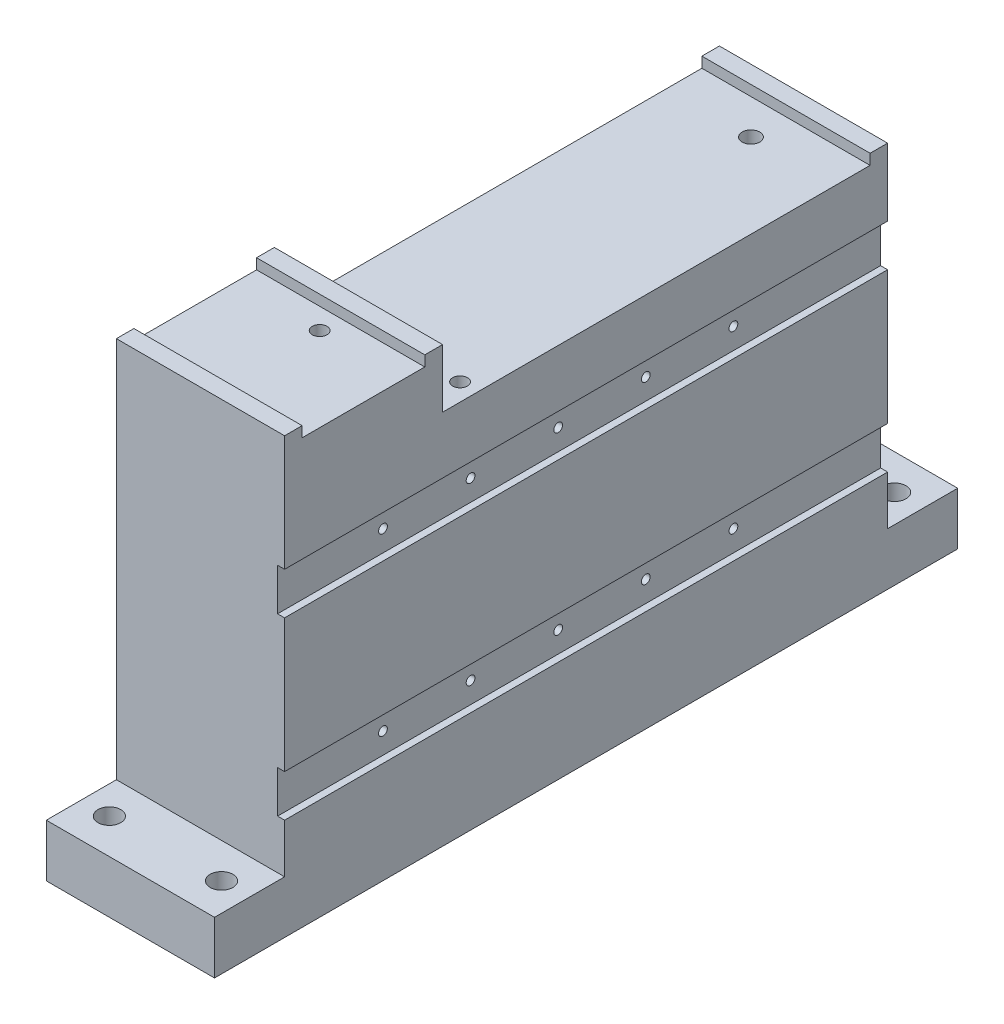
ISO-10303-21;
HEADER;
FILE_DESCRIPTION(('STEP AP214'),'2;1');
FILE_NAME('part.step','',(''),(''),'','','');
FILE_SCHEMA(('AUTOMOTIVE_DESIGN { 1 0 10303 214 1 1 1 1 }'));
ENDSEC;
DATA;
#1=APPLICATION_CONTEXT('core data for automotive mechanical design processes');
#2=APPLICATION_PROTOCOL_DEFINITION('international standard','automotive_design',2000,#1);
#3=PRODUCT_CONTEXT('',#1,'mechanical');
#4=PRODUCT('Part','Part','',(#3));
#5=PRODUCT_RELATED_PRODUCT_CATEGORY('part','',(#4));
#6=PRODUCT_DEFINITION_FORMATION('','',#4);
#7=PRODUCT_DEFINITION_CONTEXT('part definition',#1,'design');
#8=PRODUCT_DEFINITION('design','',#6,#7);
#9=PRODUCT_DEFINITION_SHAPE('','',#8);
#10=(LENGTH_UNIT() NAMED_UNIT(*) SI_UNIT(.MILLI.,.METRE.));
#11=(NAMED_UNIT(*) PLANE_ANGLE_UNIT() SI_UNIT($,.RADIAN.));
#12=(NAMED_UNIT(*) SI_UNIT($,.STERADIAN.) SOLID_ANGLE_UNIT());
#13=UNCERTAINTY_MEASURE_WITH_UNIT(LENGTH_MEASURE(1.E-05),#10,'distance_accuracy_value','');
#14=(GEOMETRIC_REPRESENTATION_CONTEXT(3) GLOBAL_UNCERTAINTY_ASSIGNED_CONTEXT((#13)) GLOBAL_UNIT_ASSIGNED_CONTEXT((#10,
#11,#12)) REPRESENTATION_CONTEXT('',''));
#15=CARTESIAN_POINT('',(0.,0.,0.));
#16=DIRECTION('',(0.,0.,1.));
#17=DIRECTION('',(1.,0.,0.));
#18=AXIS2_PLACEMENT_3D('',#15,#16,#17);
#19=CARTESIAN_POINT('',(48.,0.,212.0716));
#20=DIRECTION('',(-1.,0.,0.));
#21=DIRECTION('',(0.,0.,1.));
#22=AXIS2_PLACEMENT_3D('',#19,#20,#21);
#23=PLANE('',#22);
#24=DIRECTION('',(0.,1.,0.));
#25=VECTOR('',#24,1.);
#26=CARTESIAN_POINT('',(48.,15.,20.));
#27=LINE('',#26,#25);
#28=CARTESIAN_POINT('',(48.,15.,20.));
#29=VERTEX_POINT('',#28);
#30=CARTESIAN_POINT('',(48.,29.,20.));
#31=VERTEX_POINT('',#30);
#32=EDGE_CURVE('E446',#29,#31,#27,.T.);
#33=ORIENTED_EDGE('',*,*,#32,.T.);
#34=DIRECTION('',(0.,0.,-1.));
#35=VECTOR('',#34,1.);
#36=CARTESIAN_POINT('',(48.,29.,212.0716));
#37=LINE('',#36,#35);
#38=CARTESIAN_POINT('',(48.,29.,192.071629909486));
#39=VERTEX_POINT('',#38);
#40=EDGE_CURVE('E246',#39,#31,#37,.T.);
#41=ORIENTED_EDGE('',*,*,#40,.F.);
#42=DIRECTION('',(0.,-1.,0.));
#43=VECTOR('',#42,1.);
#44=CARTESIAN_POINT('',(48.,15.,192.071629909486));
#45=LINE('',#44,#43);
#46=CARTESIAN_POINT('',(48.,15.,192.071629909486));
#47=VERTEX_POINT('',#46);
#48=EDGE_CURVE('E461',#39,#47,#45,.T.);
#49=ORIENTED_EDGE('',*,*,#48,.T.);
#50=DIRECTION('',(0.,0.,1.));
#51=VECTOR('',#50,1.);
#52=CARTESIAN_POINT('',(48.,15.,212.071629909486));
#53=LINE('',#52,#51);
#54=CARTESIAN_POINT('',(48.,15.,212.0716));
#55=VERTEX_POINT('',#54);
#56=EDGE_CURVE('E454',#47,#55,#53,.T.);
#57=ORIENTED_EDGE('',*,*,#56,.T.);
#58=DIRECTION('',(0.,1.,0.));
#59=VECTOR('',#58,1.);
#60=CARTESIAN_POINT('',(48.,0.,212.0716));
#61=LINE('',#60,#59);
#62=CARTESIAN_POINT('',(48.,0.,212.0716));
#63=VERTEX_POINT('',#62);
#64=EDGE_CURVE('E339',#63,#55,#61,.T.);
#65=ORIENTED_EDGE('',*,*,#64,.F.);
#66=DIRECTION('',(0.,0.,-1.));
#67=VECTOR('',#66,1.);
#68=CARTESIAN_POINT('',(48.,0.,212.0716));
#69=LINE('',#68,#67);
#70=CARTESIAN_POINT('',(48.,0.,0.));
#71=VERTEX_POINT('',#70);
#72=EDGE_CURVE('E249',#63,#71,#69,.T.);
#73=ORIENTED_EDGE('',*,*,#72,.T.);
#74=DIRECTION('',(0.,1.,0.));
#75=VECTOR('',#74,1.);
#76=CARTESIAN_POINT('',(48.,0.,0.));
#77=LINE('',#76,#75);
#78=CARTESIAN_POINT('',(48.,15.,0.));
#79=VERTEX_POINT('',#78);
#80=EDGE_CURVE('E345',#71,#79,#77,.T.);
#81=ORIENTED_EDGE('',*,*,#80,.T.);
#82=DIRECTION('',(0.,0.,1.));
#83=VECTOR('',#82,1.);
#84=CARTESIAN_POINT('',(48.,15.,20.));
#85=LINE('',#84,#83);
#86=EDGE_CURVE('E451',#79,#29,#85,.T.);
#87=ORIENTED_EDGE('',*,*,#86,.T.);
#88=EDGE_LOOP('',(#33,#41,#49,#57,#65,#73,#81,#87));
#89=FACE_BOUND('',#88,.T.);
#90=ADVANCED_FACE('F33',(#89),#23,.F.);
#91=CARTESIAN_POINT('',(46.,29.,212.0716));
#92=DIRECTION('',(0.,-1.,0.));
#93=DIRECTION('',(0.,0.,-1.));
#94=AXIS2_PLACEMENT_3D('',#91,#92,#93);
#95=PLANE('',#94);
#96=DIRECTION('',(1.,0.,0.));
#97=VECTOR('',#96,1.);
#98=CARTESIAN_POINT('',(46.,29.,20.));
#99=LINE('',#98,#97);
#100=CARTESIAN_POINT('',(46.,29.,20.));
#101=VERTEX_POINT('',#100);
#102=EDGE_CURVE('E293',#101,#31,#99,.T.);
#103=ORIENTED_EDGE('',*,*,#102,.F.);
#104=DIRECTION('',(0.,0.,-1.));
#105=VECTOR('',#104,1.);
#106=CARTESIAN_POINT('',(46.,29.,212.0716));
#107=LINE('',#106,#105);
#108=CARTESIAN_POINT('',(46.,29.,192.071629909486));
#109=VERTEX_POINT('',#108);
#110=EDGE_CURVE('E243',#109,#101,#107,.T.);
#111=ORIENTED_EDGE('',*,*,#110,.F.);
#112=DIRECTION('',(-1.,0.,0.));
#113=VECTOR('',#112,1.);
#114=CARTESIAN_POINT('',(46.,29.,192.071629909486));
#115=LINE('',#114,#113);
#116=EDGE_CURVE('E397',#39,#109,#115,.T.);
#117=ORIENTED_EDGE('',*,*,#116,.F.);
#118=ORIENTED_EDGE('',*,*,#40,.T.);
#119=EDGE_LOOP('',(#103,#111,#117,#118));
#120=FACE_BOUND('',#119,.T.);
#121=ADVANCED_FACE('F578',(#120),#95,.F.);
#122=CARTESIAN_POINT('',(46.,29.,212.0716));
#123=DIRECTION('',(-1.,0.,0.));
#124=DIRECTION('',(0.,0.,1.));
#125=AXIS2_PLACEMENT_3D('',#122,#123,#124);
#126=PLANE('',#125);
#127=CARTESIAN_POINT('',(46.,34.9999999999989,162.));
#128=DIRECTION('',(-1.,0.,0.));
#129=DIRECTION('',(0.,0.,1.));
#130=AXIS2_PLACEMENT_3D('',#127,#128,#129);
#131=CIRCLE('',#130,1.25);
#132=CARTESIAN_POINT('',(46.,34.9999999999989,163.25));
#133=VERTEX_POINT('',#132);
#134=EDGE_CURVE('E269',#133,#133,#131,.T.);
#135=ORIENTED_EDGE('',*,*,#134,.T.);
#136=EDGE_LOOP('',(#135));
#137=FACE_BOUND('',#136,.T.);
#138=CARTESIAN_POINT('',(46.,34.9999999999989,137.));
#139=DIRECTION('',(-1.,0.,0.));
#140=DIRECTION('',(0.,0.,1.));
#141=AXIS2_PLACEMENT_3D('',#138,#139,#140);
#142=CIRCLE('',#141,1.25);
#143=CARTESIAN_POINT('',(46.,34.9999999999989,138.25));
#144=VERTEX_POINT('',#143);
#145=EDGE_CURVE('E265',#144,#144,#142,.T.);
#146=ORIENTED_EDGE('',*,*,#145,.T.);
#147=EDGE_LOOP('',(#146));
#148=FACE_BOUND('',#147,.T.);
#149=CARTESIAN_POINT('',(46.,34.9999999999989,112.));
#150=DIRECTION('',(-1.,0.,0.));
#151=DIRECTION('',(0.,0.,1.));
#152=AXIS2_PLACEMENT_3D('',#149,#150,#151);
#153=CIRCLE('',#152,1.25);
#154=CARTESIAN_POINT('',(46.,34.9999999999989,113.25));
#155=VERTEX_POINT('',#154);
#156=EDGE_CURVE('E261',#155,#155,#153,.T.);
#157=ORIENTED_EDGE('',*,*,#156,.T.);
#158=EDGE_LOOP('',(#157));
#159=FACE_BOUND('',#158,.T.);
#160=CARTESIAN_POINT('',(46.,34.9999999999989,87.));
#161=DIRECTION('',(-1.,0.,0.));
#162=DIRECTION('',(0.,0.,1.));
#163=AXIS2_PLACEMENT_3D('',#160,#161,#162);
#164=CIRCLE('',#163,1.25);
#165=CARTESIAN_POINT('',(46.,34.9999999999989,88.25));
#166=VERTEX_POINT('',#165);
#167=EDGE_CURVE('E257',#166,#166,#164,.T.);
#168=ORIENTED_EDGE('',*,*,#167,.T.);
#169=EDGE_LOOP('',(#168));
#170=FACE_BOUND('',#169,.T.);
#171=CARTESIAN_POINT('',(46.,34.9999999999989,62.));
#172=DIRECTION('',(-1.,0.,0.));
#173=DIRECTION('',(0.,0.,1.));
#174=AXIS2_PLACEMENT_3D('',#171,#172,#173);
#175=CIRCLE('',#174,1.25);
#176=CARTESIAN_POINT('',(46.,34.9999999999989,63.25));
#177=VERTEX_POINT('',#176);
#178=EDGE_CURVE('E256',#177,#177,#175,.T.);
#179=ORIENTED_EDGE('',*,*,#178,.T.);
#180=EDGE_LOOP('',(#179));
#181=FACE_BOUND('',#180,.T.);
#182=DIRECTION('',(0.,-1.,0.));
#183=VECTOR('',#182,1.);
#184=CARTESIAN_POINT('',(46.,29.,20.));
#185=LINE('',#184,#183);
#186=CARTESIAN_POINT('',(46.,41.,20.));
#187=VERTEX_POINT('',#186);
#188=EDGE_CURVE('E387',#187,#101,#185,.T.);
#189=ORIENTED_EDGE('',*,*,#188,.F.);
#190=DIRECTION('',(0.,0.,-1.));
#191=VECTOR('',#190,1.);
#192=CARTESIAN_POINT('',(46.,41.,212.0716));
#193=LINE('',#192,#191);
#194=CARTESIAN_POINT('',(46.,41.,192.071629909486));
#195=VERTEX_POINT('',#194);
#196=EDGE_CURVE('E240',#195,#187,#193,.T.);
#197=ORIENTED_EDGE('',*,*,#196,.F.);
#198=DIRECTION('',(0.,1.,0.));
#199=VECTOR('',#198,1.);
#200=CARTESIAN_POINT('',(46.,29.,192.071629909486));
#201=LINE('',#200,#199);
#202=EDGE_CURVE('E399',#109,#195,#201,.T.);
#203=ORIENTED_EDGE('',*,*,#202,.F.);
#204=ORIENTED_EDGE('',*,*,#110,.T.);
#205=EDGE_LOOP('',(#189,#197,#203,#204));
#206=FACE_BOUND('',#205,.T.);
#207=ADVANCED_FACE('F582',(#137,#148,#159,#170,#181,#206),#126,.F.);
#208=CARTESIAN_POINT('',(46.,41.,212.0716));
#209=DIRECTION('',(0.,1.,0.));
#210=DIRECTION('',(-1.,0.,0.));
#211=AXIS2_PLACEMENT_3D('',#208,#209,#210);
#212=PLANE('',#211);
#213=DIRECTION('',(-1.,0.,0.));
#214=VECTOR('',#213,1.);
#215=CARTESIAN_POINT('',(46.,41.,20.));
#216=LINE('',#215,#214);
#217=CARTESIAN_POINT('',(48.,40.9999999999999,20.));
#218=VERTEX_POINT('',#217);
#219=EDGE_CURVE('E389',#218,#187,#216,.T.);
#220=ORIENTED_EDGE('',*,*,#219,.F.);
#221=DIRECTION('',(0.,0.,-1.));
#222=VECTOR('',#221,1.);
#223=CARTESIAN_POINT('',(48.,40.9999999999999,212.0716));
#224=LINE('',#223,#222);
#225=CARTESIAN_POINT('',(48.,40.9999999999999,192.071629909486));
#226=VERTEX_POINT('',#225);
#227=EDGE_CURVE('E237',#226,#218,#224,.T.);
#228=ORIENTED_EDGE('',*,*,#227,.F.);
#229=DIRECTION('',(1.,0.,0.));
#230=VECTOR('',#229,1.);
#231=CARTESIAN_POINT('',(46.,41.,192.071629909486));
#232=LINE('',#231,#230);
#233=EDGE_CURVE('E401',#195,#226,#232,.T.);
#234=ORIENTED_EDGE('',*,*,#233,.F.);
#235=ORIENTED_EDGE('',*,*,#196,.T.);
#236=EDGE_LOOP('',(#220,#228,#234,#235));
#237=FACE_BOUND('',#236,.T.);
#238=ADVANCED_FACE('F588',(#237),#212,.F.);
#239=CARTESIAN_POINT('',(48.,40.9999999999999,212.0716));
#240=DIRECTION('',(-1.,0.,0.));
#241=DIRECTION('',(0.,0.,1.));
#242=AXIS2_PLACEMENT_3D('',#239,#240,#241);
#243=PLANE('',#242);
#244=CARTESIAN_POINT('',(48.,78.9999999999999,20.));
#245=VERTEX_POINT('',#244);
#246=EDGE_CURVE('E449',#218,#245,#27,.T.);
#247=ORIENTED_EDGE('',*,*,#246,.T.);
#248=DIRECTION('',(0.,0.,-1.));
#249=VECTOR('',#248,1.);
#250=CARTESIAN_POINT('',(48.,78.9999999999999,212.0716));
#251=LINE('',#250,#249);
#252=CARTESIAN_POINT('',(48.,78.9999999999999,192.071629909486));
#253=VERTEX_POINT('',#252);
#254=EDGE_CURVE('E234',#253,#245,#251,.T.);
#255=ORIENTED_EDGE('',*,*,#254,.F.);
#256=EDGE_CURVE('E460',#253,#226,#45,.T.);
#257=ORIENTED_EDGE('',*,*,#256,.T.);
#258=ORIENTED_EDGE('',*,*,#227,.T.);
#259=EDGE_LOOP('',(#247,#255,#257,#258));
#260=FACE_BOUND('',#259,.T.);
#261=ADVANCED_FACE('F539',(#260),#243,.F.);
#262=CARTESIAN_POINT('',(46.,78.9999999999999,212.0716));
#263=DIRECTION('',(0.,-1.,0.));
#264=DIRECTION('',(0.,0.,-1.));
#265=AXIS2_PLACEMENT_3D('',#262,#263,#264);
#266=PLANE('',#265);
#267=DIRECTION('',(1.,0.,0.));
#268=VECTOR('',#267,1.);
#269=CARTESIAN_POINT('',(46.,78.9999999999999,20.));
#270=LINE('',#269,#268);
#271=CARTESIAN_POINT('',(46.,78.9999999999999,20.));
#272=VERTEX_POINT('',#271);
#273=EDGE_CURVE('E391',#272,#245,#270,.T.);
#274=ORIENTED_EDGE('',*,*,#273,.F.);
#275=DIRECTION('',(0.,0.,-1.));
#276=VECTOR('',#275,1.);
#277=CARTESIAN_POINT('',(46.,78.9999999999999,212.0716));
#278=LINE('',#277,#276);
#279=CARTESIAN_POINT('',(46.,78.9999999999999,192.071629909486));
#280=VERTEX_POINT('',#279);
#281=EDGE_CURVE('E231',#280,#272,#278,.T.);
#282=ORIENTED_EDGE('',*,*,#281,.F.);
#283=DIRECTION('',(-1.,0.,0.));
#284=VECTOR('',#283,1.);
#285=CARTESIAN_POINT('',(46.,78.9999999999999,192.071629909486));
#286=LINE('',#285,#284);
#287=EDGE_CURVE('E403',#253,#280,#286,.T.);
#288=ORIENTED_EDGE('',*,*,#287,.F.);
#289=ORIENTED_EDGE('',*,*,#254,.T.);
#290=EDGE_LOOP('',(#274,#282,#288,#289));
#291=FACE_BOUND('',#290,.T.);
#292=ADVANCED_FACE('F534',(#291),#266,.F.);
#293=CARTESIAN_POINT('',(46.,78.9999999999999,212.0716));
#294=DIRECTION('',(-1.,0.,0.));
#295=DIRECTION('',(0.,0.,1.));
#296=AXIS2_PLACEMENT_3D('',#293,#294,#295);
#297=PLANE('',#296);
#298=CARTESIAN_POINT('',(46.,84.9999999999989,62.));
#299=DIRECTION('',(-1.,0.,0.));
#300=DIRECTION('',(0.,0.,1.));
#301=AXIS2_PLACEMENT_3D('',#298,#299,#300);
#302=CIRCLE('',#301,1.25);
#303=CARTESIAN_POINT('',(46.,84.9999999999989,63.25));
#304=VERTEX_POINT('',#303);
#305=EDGE_CURVE('E289',#304,#304,#302,.T.);
#306=ORIENTED_EDGE('',*,*,#305,.T.);
#307=EDGE_LOOP('',(#306));
#308=FACE_BOUND('',#307,.T.);
#309=CARTESIAN_POINT('',(46.,84.9999999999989,87.));
#310=DIRECTION('',(-1.,0.,0.));
#311=DIRECTION('',(0.,0.,1.));
#312=AXIS2_PLACEMENT_3D('',#309,#310,#311);
#313=CIRCLE('',#312,1.25);
#314=CARTESIAN_POINT('',(46.,84.9999999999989,88.25));
#315=VERTEX_POINT('',#314);
#316=EDGE_CURVE('E285',#315,#315,#313,.T.);
#317=ORIENTED_EDGE('',*,*,#316,.T.);
#318=EDGE_LOOP('',(#317));
#319=FACE_BOUND('',#318,.T.);
#320=CARTESIAN_POINT('',(46.,84.9999999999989,112.));
#321=DIRECTION('',(-1.,0.,0.));
#322=DIRECTION('',(0.,0.,1.));
#323=AXIS2_PLACEMENT_3D('',#320,#321,#322);
#324=CIRCLE('',#323,1.25);
#325=CARTESIAN_POINT('',(46.,84.9999999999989,113.25));
#326=VERTEX_POINT('',#325);
#327=EDGE_CURVE('E281',#326,#326,#324,.T.);
#328=ORIENTED_EDGE('',*,*,#327,.T.);
#329=EDGE_LOOP('',(#328));
#330=FACE_BOUND('',#329,.T.);
#331=CARTESIAN_POINT('',(46.,84.9999999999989,137.));
#332=DIRECTION('',(-1.,0.,0.));
#333=DIRECTION('',(0.,0.,1.));
#334=AXIS2_PLACEMENT_3D('',#331,#332,#333);
#335=CIRCLE('',#334,1.25);
#336=CARTESIAN_POINT('',(46.,84.9999999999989,138.25));
#337=VERTEX_POINT('',#336);
#338=EDGE_CURVE('E277',#337,#337,#335,.T.);
#339=ORIENTED_EDGE('',*,*,#338,.T.);
#340=EDGE_LOOP('',(#339));
#341=FACE_BOUND('',#340,.T.);
#342=CARTESIAN_POINT('',(46.,85.,162.));
#343=DIRECTION('',(-1.,0.,0.));
#344=DIRECTION('',(0.,0.,1.));
#345=AXIS2_PLACEMENT_3D('',#342,#343,#344);
#346=CIRCLE('',#345,1.25);
#347=CARTESIAN_POINT('',(46.,85.,163.25));
#348=VERTEX_POINT('',#347);
#349=EDGE_CURVE('E273',#348,#348,#346,.T.);
#350=ORIENTED_EDGE('',*,*,#349,.T.);
#351=EDGE_LOOP('',(#350));
#352=FACE_BOUND('',#351,.T.);
#353=DIRECTION('',(0.,-1.,0.));
#354=VECTOR('',#353,1.);
#355=CARTESIAN_POINT('',(46.,78.9999999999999,20.));
#356=LINE('',#355,#354);
#357=CARTESIAN_POINT('',(46.,90.9999999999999,20.));
#358=VERTEX_POINT('',#357);
#359=EDGE_CURVE('E393',#358,#272,#356,.T.);
#360=ORIENTED_EDGE('',*,*,#359,.F.);
#361=DIRECTION('',(0.,0.,-1.));
#362=VECTOR('',#361,1.);
#363=CARTESIAN_POINT('',(46.,90.9999999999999,212.0716));
#364=LINE('',#363,#362);
#365=CARTESIAN_POINT('',(46.,90.9999999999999,192.071629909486));
#366=VERTEX_POINT('',#365);
#367=EDGE_CURVE('E228',#366,#358,#364,.T.);
#368=ORIENTED_EDGE('',*,*,#367,.F.);
#369=DIRECTION('',(0.,1.,0.));
#370=VECTOR('',#369,1.);
#371=CARTESIAN_POINT('',(46.,78.9999999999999,192.071629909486));
#372=LINE('',#371,#370);
#373=EDGE_CURVE('E405',#280,#366,#372,.T.);
#374=ORIENTED_EDGE('',*,*,#373,.F.);
#375=ORIENTED_EDGE('',*,*,#281,.T.);
#376=EDGE_LOOP('',(#360,#368,#374,#375));
#377=FACE_BOUND('',#376,.T.);
#378=ADVANCED_FACE('F529',(#308,#319,#330,#341,#352,#377),#297,.F.);
#379=CARTESIAN_POINT('',(46.,90.9999999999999,212.0716));
#380=DIRECTION('',(0.,1.,0.));
#381=DIRECTION('',(0.,0.,1.));
#382=AXIS2_PLACEMENT_3D('',#379,#380,#381);
#383=PLANE('',#382);
#384=DIRECTION('',(-1.,0.,0.));
#385=VECTOR('',#384,1.);
#386=CARTESIAN_POINT('',(46.,90.9999999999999,20.));
#387=LINE('',#386,#385);
#388=CARTESIAN_POINT('',(48.,90.9999999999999,20.));
#389=VERTEX_POINT('',#388);
#390=EDGE_CURVE('E395',#389,#358,#387,.T.);
#391=ORIENTED_EDGE('',*,*,#390,.F.);
#392=DIRECTION('',(0.,0.,-1.));
#393=VECTOR('',#392,1.);
#394=CARTESIAN_POINT('',(48.,90.9999999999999,212.0716));
#395=LINE('',#394,#393);
#396=CARTESIAN_POINT('',(48.,90.9999999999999,192.071629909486));
#397=VERTEX_POINT('',#396);
#398=EDGE_CURVE('E221',#397,#389,#395,.T.);
#399=ORIENTED_EDGE('',*,*,#398,.F.);
#400=DIRECTION('',(1.,0.,0.));
#401=VECTOR('',#400,1.);
#402=CARTESIAN_POINT('',(46.,90.9999999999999,192.071629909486));
#403=LINE('',#402,#401);
#404=EDGE_CURVE('E407',#366,#397,#403,.T.);
#405=ORIENTED_EDGE('',*,*,#404,.F.);
#406=ORIENTED_EDGE('',*,*,#367,.T.);
#407=EDGE_LOOP('',(#391,#399,#405,#406));
#408=FACE_BOUND('',#407,.T.);
#409=ADVANCED_FACE('F522',(#408),#383,.F.);
#410=CARTESIAN_POINT('',(48.,90.9999999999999,212.0716));
#411=DIRECTION('',(-1.,0.,0.));
#412=DIRECTION('',(0.,0.,1.));
#413=AXIS2_PLACEMENT_3D('',#410,#411,#412);
#414=PLANE('',#413);
#415=DIRECTION('',(0.,1.,0.));
#416=VECTOR('',#415,1.);
#417=CARTESIAN_POINT('',(48.,107.280000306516,147.));
#418=LINE('',#417,#416);
#419=CARTESIAN_POINT('',(48.,107.280000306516,147.));
#420=VERTEX_POINT('',#419);
#421=CARTESIAN_POINT('',(48.,124.,147.));
#422=VERTEX_POINT('',#421);
#423=EDGE_CURVE('E201',#420,#422,#418,.T.);
#424=ORIENTED_EDGE('',*,*,#423,.T.);
#425=DIRECTION('',(0.,0.,-1.));
#426=VECTOR('',#425,1.);
#427=CARTESIAN_POINT('',(48.,124.,212.0716));
#428=LINE('',#427,#426);
#429=CARTESIAN_POINT('',(48.,124.,152.071629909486));
#430=VERTEX_POINT('',#429);
#431=EDGE_CURVE('E208',#430,#422,#428,.T.);
#432=ORIENTED_EDGE('',*,*,#431,.F.);
#433=DIRECTION('',(0.,-1.,0.));
#434=VECTOR('',#433,1.);
#435=CARTESIAN_POINT('',(48.,121.,152.071629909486));
#436=LINE('',#435,#434);
#437=CARTESIAN_POINT('',(48.,121.,152.071629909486));
#438=VERTEX_POINT('',#437);
#439=EDGE_CURVE('E192',#430,#438,#436,.T.);
#440=ORIENTED_EDGE('',*,*,#439,.T.);
#441=DIRECTION('',(0.,0.,1.));
#442=VECTOR('',#441,1.);
#443=CARTESIAN_POINT('',(48.,121.,187.071629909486));
#444=LINE('',#443,#442);
#445=CARTESIAN_POINT('',(48.,121.,187.071629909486));
#446=VERTEX_POINT('',#445);
#447=EDGE_CURVE('E200',#438,#446,#444,.T.);
#448=ORIENTED_EDGE('',*,*,#447,.T.);
#449=DIRECTION('',(0.,1.,0.));
#450=VECTOR('',#449,1.);
#451=CARTESIAN_POINT('',(48.,121.,187.071629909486));
#452=LINE('',#451,#450);
#453=CARTESIAN_POINT('',(48.,124.,187.071629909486));
#454=VERTEX_POINT('',#453);
#455=EDGE_CURVE('E462',#446,#454,#452,.T.);
#456=ORIENTED_EDGE('',*,*,#455,.T.);
#457=CARTESIAN_POINT('',(48.,124.,192.071629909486));
#458=VERTEX_POINT('',#457);
#459=EDGE_CURVE('E217',#458,#454,#428,.T.);
#460=ORIENTED_EDGE('',*,*,#459,.F.);
#461=EDGE_CURVE('E457',#458,#397,#45,.T.);
#462=ORIENTED_EDGE('',*,*,#461,.T.);
#463=ORIENTED_EDGE('',*,*,#398,.T.);
#464=CARTESIAN_POINT('',(48.,110.280000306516,20.));
#465=VERTEX_POINT('',#464);
#466=EDGE_CURVE('E450',#389,#465,#27,.T.);
#467=ORIENTED_EDGE('',*,*,#466,.T.);
#468=DIRECTION('',(0.,0.,1.));
#469=VECTOR('',#468,1.);
#470=CARTESIAN_POINT('',(48.,110.280000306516,25.));
#471=LINE('',#470,#469);
#472=CARTESIAN_POINT('',(48.,110.280000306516,25.));
#473=VERTEX_POINT('',#472);
#474=EDGE_CURVE('E443',#465,#473,#471,.T.);
#475=ORIENTED_EDGE('',*,*,#474,.T.);
#476=DIRECTION('',(0.,-1.,0.));
#477=VECTOR('',#476,1.);
#478=CARTESIAN_POINT('',(48.,107.280000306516,25.));
#479=LINE('',#478,#477);
#480=CARTESIAN_POINT('',(48.,107.280000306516,25.));
#481=VERTEX_POINT('',#480);
#482=EDGE_CURVE('E440',#473,#481,#479,.T.);
#483=ORIENTED_EDGE('',*,*,#482,.T.);
#484=DIRECTION('',(0.,0.,1.));
#485=VECTOR('',#484,1.);
#486=CARTESIAN_POINT('',(48.,107.280000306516,147.));
#487=LINE('',#486,#485);
#488=EDGE_CURVE('E417',#481,#420,#487,.T.);
#489=ORIENTED_EDGE('',*,*,#488,.T.);
#490=EDGE_LOOP('',(#424,#432,#440,#448,#456,#460,#462,#463,#467,#475,#483,#489));
#491=FACE_BOUND('',#490,.T.);
#492=ADVANCED_FACE('F214',(#491),#414,.F.);
#493=CARTESIAN_POINT('',(0.,124.,212.0716));
#494=DIRECTION('',(0.,-1.,0.));
#495=DIRECTION('',(0.,0.,-1.));
#496=AXIS2_PLACEMENT_3D('',#493,#494,#495);
#497=PLANE('',#496);
#498=DIRECTION('',(1.,0.,0.));
#499=VECTOR('',#498,1.);
#500=CARTESIAN_POINT('',(-164.0716,124.,147.));
#501=LINE('',#500,#499);
#502=CARTESIAN_POINT('',(0.,124.,147.));
#503=VERTEX_POINT('',#502);
#504=EDGE_CURVE('E211',#503,#422,#501,.T.);
#505=ORIENTED_EDGE('',*,*,#504,.F.);
#506=DIRECTION('',(0.,0.,-1.));
#507=VECTOR('',#506,1.);
#508=CARTESIAN_POINT('',(0.,124.,212.0716));
#509=LINE('',#508,#507);
#510=CARTESIAN_POINT('',(0.,124.,152.071629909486));
#511=VERTEX_POINT('',#510);
#512=EDGE_CURVE('E210',#511,#503,#509,.T.);
#513=ORIENTED_EDGE('',*,*,#512,.F.);
#514=DIRECTION('',(1.,0.,0.));
#515=VECTOR('',#514,1.);
#516=CARTESIAN_POINT('',(-164.0716,124.,152.071629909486));
#517=LINE('',#516,#515);
#518=EDGE_CURVE('E48',#511,#430,#517,.T.);
#519=ORIENTED_EDGE('',*,*,#518,.T.);
#520=ORIENTED_EDGE('',*,*,#431,.T.);
#521=EDGE_LOOP('',(#505,#513,#519,#520));
#522=FACE_BOUND('',#521,.T.);
#523=ADVANCED_FACE('F207',(#522),#497,.F.);
#524=DIRECTION('',(1.,0.,0.));
#525=VECTOR('',#524,1.);
#526=CARTESIAN_POINT('',(-164.0716,124.,192.071629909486));
#527=LINE('',#526,#525);
#528=CARTESIAN_POINT('',(0.,124.,192.071629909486));
#529=VERTEX_POINT('',#528);
#530=EDGE_CURVE('E424',#529,#458,#527,.T.);
#531=ORIENTED_EDGE('',*,*,#530,.T.);
#532=ORIENTED_EDGE('',*,*,#459,.T.);
#533=DIRECTION('',(1.,0.,0.));
#534=VECTOR('',#533,1.);
#535=CARTESIAN_POINT('',(-164.0716,124.,187.071629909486));
#536=LINE('',#535,#534);
#537=CARTESIAN_POINT('',(0.,124.,187.071629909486));
#538=VERTEX_POINT('',#537);
#539=EDGE_CURVE('E422',#538,#454,#536,.T.);
#540=ORIENTED_EDGE('',*,*,#539,.F.);
#541=EDGE_CURVE('E218',#529,#538,#509,.T.);
#542=ORIENTED_EDGE('',*,*,#541,.F.);
#543=EDGE_LOOP('',(#531,#532,#540,#542));
#544=FACE_BOUND('',#543,.T.);
#545=ADVANCED_FACE('F514',(#544),#497,.F.);
#546=CARTESIAN_POINT('',(0.,0.,212.0716));
#547=DIRECTION('',(1.,0.,0.));
#548=DIRECTION('',(0.,0.,-1.));
#549=AXIS2_PLACEMENT_3D('',#546,#547,#548);
#550=PLANE('',#549);
#551=CARTESIAN_POINT('',(0.,34.9999999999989,62.));
#552=DIRECTION('',(1.,0.,0.));
#553=DIRECTION('',(0.,0.,-1.));
#554=AXIS2_PLACEMENT_3D('',#551,#552,#553);
#555=CIRCLE('',#554,1.25);
#556=CARTESIAN_POINT('',(0.,34.9999999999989,60.75));
#557=VERTEX_POINT('',#556);
#558=EDGE_CURVE('E253',#557,#557,#555,.T.);
#559=ORIENTED_EDGE('',*,*,#558,.T.);
#560=EDGE_LOOP('',(#559));
#561=FACE_BOUND('',#560,.T.);
#562=CARTESIAN_POINT('',(0.,34.9999999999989,87.));
#563=DIRECTION('',(1.,0.,0.));
#564=DIRECTION('',(0.,0.,-1.));
#565=AXIS2_PLACEMENT_3D('',#562,#563,#564);
#566=CIRCLE('',#565,1.25);
#567=CARTESIAN_POINT('',(0.,34.9999999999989,85.75));
#568=VERTEX_POINT('',#567);
#569=EDGE_CURVE('E258',#568,#568,#566,.T.);
#570=ORIENTED_EDGE('',*,*,#569,.T.);
#571=EDGE_LOOP('',(#570));
#572=FACE_BOUND('',#571,.T.);
#573=CARTESIAN_POINT('',(0.,34.9999999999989,112.));
#574=DIRECTION('',(1.,0.,0.));
#575=DIRECTION('',(0.,0.,-1.));
#576=AXIS2_PLACEMENT_3D('',#573,#574,#575);
#577=CIRCLE('',#576,1.25);
#578=CARTESIAN_POINT('',(0.,34.9999999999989,110.75));
#579=VERTEX_POINT('',#578);
#580=EDGE_CURVE('E262',#579,#579,#577,.T.);
#581=ORIENTED_EDGE('',*,*,#580,.T.);
#582=EDGE_LOOP('',(#581));
#583=FACE_BOUND('',#582,.T.);
#584=CARTESIAN_POINT('',(0.,34.9999999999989,137.));
#585=DIRECTION('',(1.,0.,0.));
#586=DIRECTION('',(0.,0.,-1.));
#587=AXIS2_PLACEMENT_3D('',#584,#585,#586);
#588=CIRCLE('',#587,1.25);
#589=CARTESIAN_POINT('',(0.,34.9999999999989,135.75));
#590=VERTEX_POINT('',#589);
#591=EDGE_CURVE('E266',#590,#590,#588,.T.);
#592=ORIENTED_EDGE('',*,*,#591,.T.);
#593=EDGE_LOOP('',(#592));
#594=FACE_BOUND('',#593,.T.);
#595=CARTESIAN_POINT('',(0.,34.9999999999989,162.));
#596=DIRECTION('',(1.,0.,0.));
#597=DIRECTION('',(0.,0.,-1.));
#598=AXIS2_PLACEMENT_3D('',#595,#596,#597);
#599=CIRCLE('',#598,1.25);
#600=CARTESIAN_POINT('',(0.,34.9999999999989,160.75));
#601=VERTEX_POINT('',#600);
#602=EDGE_CURVE('E270',#601,#601,#599,.T.);
#603=ORIENTED_EDGE('',*,*,#602,.T.);
#604=EDGE_LOOP('',(#603));
#605=FACE_BOUND('',#604,.T.);
#606=CARTESIAN_POINT('',(0.,85.,162.));
#607=DIRECTION('',(1.,0.,0.));
#608=DIRECTION('',(0.,0.,-1.));
#609=AXIS2_PLACEMENT_3D('',#606,#607,#608);
#610=CIRCLE('',#609,1.25);
#611=CARTESIAN_POINT('',(0.,85.,160.75));
#612=VERTEX_POINT('',#611);
#613=EDGE_CURVE('E274',#612,#612,#610,.T.);
#614=ORIENTED_EDGE('',*,*,#613,.T.);
#615=EDGE_LOOP('',(#614));
#616=FACE_BOUND('',#615,.T.);
#617=CARTESIAN_POINT('',(0.,84.9999999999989,137.));
#618=DIRECTION('',(1.,0.,0.));
#619=DIRECTION('',(0.,0.,-1.));
#620=AXIS2_PLACEMENT_3D('',#617,#618,#619);
#621=CIRCLE('',#620,1.25);
#622=CARTESIAN_POINT('',(0.,84.9999999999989,135.75));
#623=VERTEX_POINT('',#622);
#624=EDGE_CURVE('E278',#623,#623,#621,.T.);
#625=ORIENTED_EDGE('',*,*,#624,.T.);
#626=EDGE_LOOP('',(#625));
#627=FACE_BOUND('',#626,.T.);
#628=CARTESIAN_POINT('',(0.,84.9999999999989,112.));
#629=DIRECTION('',(1.,0.,0.));
#630=DIRECTION('',(0.,0.,-1.));
#631=AXIS2_PLACEMENT_3D('',#628,#629,#630);
#632=CIRCLE('',#631,1.25);
#633=CARTESIAN_POINT('',(0.,84.9999999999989,110.75));
#634=VERTEX_POINT('',#633);
#635=EDGE_CURVE('E282',#634,#634,#632,.T.);
#636=ORIENTED_EDGE('',*,*,#635,.T.);
#637=EDGE_LOOP('',(#636));
#638=FACE_BOUND('',#637,.T.);
#639=CARTESIAN_POINT('',(0.,84.9999999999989,87.));
#640=DIRECTION('',(1.,0.,0.));
#641=DIRECTION('',(0.,0.,-1.));
#642=AXIS2_PLACEMENT_3D('',#639,#640,#641);
#643=CIRCLE('',#642,1.25);
#644=CARTESIAN_POINT('',(0.,84.9999999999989,85.75));
#645=VERTEX_POINT('',#644);
#646=EDGE_CURVE('E286',#645,#645,#643,.T.);
#647=ORIENTED_EDGE('',*,*,#646,.T.);
#648=EDGE_LOOP('',(#647));
#649=FACE_BOUND('',#648,.T.);
#650=CARTESIAN_POINT('',(0.,84.9999999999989,62.));
#651=DIRECTION('',(1.,0.,0.));
#652=DIRECTION('',(0.,0.,-1.));
#653=AXIS2_PLACEMENT_3D('',#650,#651,#652);
#654=CIRCLE('',#653,1.25);
#655=CARTESIAN_POINT('',(0.,84.9999999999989,60.75));
#656=VERTEX_POINT('',#655);
#657=EDGE_CURVE('E290',#656,#656,#654,.T.);
#658=ORIENTED_EDGE('',*,*,#657,.T.);
#659=EDGE_LOOP('',(#658));
#660=FACE_BOUND('',#659,.T.);
#661=DIRECTION('',(0.,1.,0.));
#662=VECTOR('',#661,1.);
#663=CARTESIAN_POINT('',(0.,0.,147.));
#664=LINE('',#663,#662);
#665=CARTESIAN_POINT('',(0.,107.280000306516,147.));
#666=VERTEX_POINT('',#665);
#667=EDGE_CURVE('E12',#666,#503,#664,.T.);
#668=ORIENTED_EDGE('',*,*,#667,.F.);
#669=DIRECTION('',(0.,0.,1.));
#670=VECTOR('',#669,1.);
#671=CARTESIAN_POINT('',(0.,107.280000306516,212.0716));
#672=LINE('',#671,#670);
#673=CARTESIAN_POINT('',(0.,107.280000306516,25.));
#674=VERTEX_POINT('',#673);
#675=EDGE_CURVE('E41',#674,#666,#672,.T.);
#676=ORIENTED_EDGE('',*,*,#675,.F.);
#677=DIRECTION('',(0.,-1.,0.));
#678=VECTOR('',#677,1.);
#679=CARTESIAN_POINT('',(0.,0.,25.));
#680=LINE('',#679,#678);
#681=CARTESIAN_POINT('',(0.,110.280000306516,25.));
#682=VERTEX_POINT('',#681);
#683=EDGE_CURVE('E315',#682,#674,#680,.T.);
#684=ORIENTED_EDGE('',*,*,#683,.F.);
#685=DIRECTION('',(0.,0.,1.));
#686=VECTOR('',#685,1.);
#687=CARTESIAN_POINT('',(0.,110.280000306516,212.0716));
#688=LINE('',#687,#686);
#689=CARTESIAN_POINT('',(0.,110.280000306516,20.));
#690=VERTEX_POINT('',#689);
#691=EDGE_CURVE('E313',#690,#682,#688,.T.);
#692=ORIENTED_EDGE('',*,*,#691,.F.);
#693=DIRECTION('',(0.,1.,0.));
#694=VECTOR('',#693,1.);
#695=CARTESIAN_POINT('',(0.,0.,20.));
#696=LINE('',#695,#694);
#697=CARTESIAN_POINT('',(0.,15.,20.));
#698=VERTEX_POINT('',#697);
#699=EDGE_CURVE('E311',#698,#690,#696,.T.);
#700=ORIENTED_EDGE('',*,*,#699,.F.);
#701=DIRECTION('',(0.,0.,1.));
#702=VECTOR('',#701,1.);
#703=CARTESIAN_POINT('',(0.,15.,212.0716));
#704=LINE('',#703,#702);
#705=CARTESIAN_POINT('',(0.,15.,0.));
#706=VERTEX_POINT('',#705);
#707=EDGE_CURVE('E303',#706,#698,#704,.T.);
#708=ORIENTED_EDGE('',*,*,#707,.F.);
#709=DIRECTION('',(0.,-1.,0.));
#710=VECTOR('',#709,1.);
#711=CARTESIAN_POINT('',(0.,0.,0.));
#712=LINE('',#711,#710);
#713=CARTESIAN_POINT('',(0.,0.,0.));
#714=VERTEX_POINT('',#713);
#715=EDGE_CURVE('E342',#706,#714,#712,.T.);
#716=ORIENTED_EDGE('',*,*,#715,.T.);
#717=DIRECTION('',(0.,0.,-1.));
#718=VECTOR('',#717,1.);
#719=CARTESIAN_POINT('',(0.,0.,212.0716));
#720=LINE('',#719,#718);
#721=CARTESIAN_POINT('',(0.,0.,212.0716));
#722=VERTEX_POINT('',#721);
#723=EDGE_CURVE('E331',#722,#714,#720,.T.);
#724=ORIENTED_EDGE('',*,*,#723,.F.);
#725=DIRECTION('',(0.,-1.,0.));
#726=VECTOR('',#725,1.);
#727=CARTESIAN_POINT('',(0.,0.,212.0716));
#728=LINE('',#727,#726);
#729=CARTESIAN_POINT('',(0.,15.,212.0716));
#730=VERTEX_POINT('',#729);
#731=EDGE_CURVE('E333',#730,#722,#728,.T.);
#732=ORIENTED_EDGE('',*,*,#731,.F.);
#733=DIRECTION('',(0.,0.,1.));
#734=VECTOR('',#733,1.);
#735=CARTESIAN_POINT('',(0.,15.,212.0716));
#736=LINE('',#735,#734);
#737=CARTESIAN_POINT('',(0.,15.,192.071629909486));
#738=VERTEX_POINT('',#737);
#739=EDGE_CURVE('E56',#738,#730,#736,.T.);
#740=ORIENTED_EDGE('',*,*,#739,.F.);
#741=DIRECTION('',(0.,-1.,0.));
#742=VECTOR('',#741,1.);
#743=CARTESIAN_POINT('',(0.,0.,192.071629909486));
#744=LINE('',#743,#742);
#745=EDGE_CURVE('E309',#529,#738,#744,.T.);
#746=ORIENTED_EDGE('',*,*,#745,.F.);
#747=ORIENTED_EDGE('',*,*,#541,.T.);
#748=DIRECTION('',(0.,1.,0.));
#749=VECTOR('',#748,1.);
#750=CARTESIAN_POINT('',(0.,0.,187.071629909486));
#751=LINE('',#750,#749);
#752=CARTESIAN_POINT('',(0.,121.,187.071629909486));
#753=VERTEX_POINT('',#752);
#754=EDGE_CURVE('E307',#753,#538,#751,.T.);
#755=ORIENTED_EDGE('',*,*,#754,.F.);
#756=DIRECTION('',(0.,0.,1.));
#757=VECTOR('',#756,1.);
#758=CARTESIAN_POINT('',(0.,121.,212.0716));
#759=LINE('',#758,#757);
#760=CARTESIAN_POINT('',(0.,121.,152.071629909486));
#761=VERTEX_POINT('',#760);
#762=EDGE_CURVE('E305',#761,#753,#759,.T.);
#763=ORIENTED_EDGE('',*,*,#762,.F.);
#764=DIRECTION('',(0.,-1.,0.));
#765=VECTOR('',#764,1.);
#766=CARTESIAN_POINT('',(0.,0.,152.071629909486));
#767=LINE('',#766,#765);
#768=EDGE_CURVE('E252',#511,#761,#767,.T.);
#769=ORIENTED_EDGE('',*,*,#768,.F.);
#770=ORIENTED_EDGE('',*,*,#512,.T.);
#771=EDGE_LOOP('',(#668,#676,#684,#692,#700,#708,#716,#724,#732,#740,#746,#747,#755,#763,#769,#770));
#772=FACE_BOUND('',#771,.T.);
#773=ADVANCED_FACE('F329',(#561,#572,#583,#594,#605,#616,#627,#638,#649,#660,#772),#550,.F.);
#774=CARTESIAN_POINT('',(48.,0.,212.0716));
#775=DIRECTION('',(0.,0.,1.));
#776=DIRECTION('',(1.,0.,0.));
#777=AXIS2_PLACEMENT_3D('',#774,#775,#776);
#778=PLANE('',#777);
#779=ORIENTED_EDGE('',*,*,#64,.T.);
#780=DIRECTION('',(-1.,0.,0.));
#781=VECTOR('',#780,1.);
#782=CARTESIAN_POINT('',(48.,15.,212.0716));
#783=LINE('',#782,#781);
#784=EDGE_CURVE('E410',#55,#730,#783,.T.);
#785=ORIENTED_EDGE('',*,*,#784,.T.);
#786=ORIENTED_EDGE('',*,*,#731,.T.);
#787=DIRECTION('',(1.,0.,0.));
#788=VECTOR('',#787,1.);
#789=CARTESIAN_POINT('',(0.,0.,212.0716));
#790=LINE('',#789,#788);
#791=EDGE_CURVE('E344',#722,#63,#790,.T.);
#792=ORIENTED_EDGE('',*,*,#791,.T.);
#793=EDGE_LOOP('',(#779,#785,#786,#792));
#794=FACE_BOUND('',#793,.T.);
#795=ADVANCED_FACE('F608',(#794),#778,.T.);
#796=CARTESIAN_POINT('',(48.,0.,0.));
#797=DIRECTION('',(0.,0.,1.));
#798=DIRECTION('',(1.,0.,0.));
#799=AXIS2_PLACEMENT_3D('',#796,#797,#798);
#800=PLANE('',#799);
#801=DIRECTION('',(1.,0.,0.));
#802=VECTOR('',#801,1.);
#803=CARTESIAN_POINT('',(-164.0716,15.,0.));
#804=LINE('',#803,#802);
#805=EDGE_CURVE('E429',#706,#79,#804,.T.);
#806=ORIENTED_EDGE('',*,*,#805,.T.);
#807=ORIENTED_EDGE('',*,*,#80,.F.);
#808=DIRECTION('',(1.,0.,0.));
#809=VECTOR('',#808,1.);
#810=CARTESIAN_POINT('',(0.,0.,0.));
#811=LINE('',#810,#809);
#812=EDGE_CURVE('E348',#714,#71,#811,.T.);
#813=ORIENTED_EDGE('',*,*,#812,.F.);
#814=ORIENTED_EDGE('',*,*,#715,.F.);
#815=EDGE_LOOP('',(#806,#807,#813,#814));
#816=FACE_BOUND('',#815,.T.);
#817=ADVANCED_FACE('F559',(#816),#800,.F.);
#818=CARTESIAN_POINT('',(8.,-88.0716000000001,202.071630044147));
#819=DIRECTION('',(0.,1.,0.));
#820=DIRECTION('',(0.,0.,1.));
#821=AXIS2_PLACEMENT_3D('',#818,#819,#820);
#822=CYLINDRICAL_SURFACE('',#821,3.25);
#823=CARTESIAN_POINT('',(8.,0.,202.071630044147));
#824=DIRECTION('',(0.,1.,0.));
#825=DIRECTION('',(0.,0.,1.));
#826=AXIS2_PLACEMENT_3D('',#823,#824,#825);
#827=CIRCLE('',#826,3.25);
#828=CARTESIAN_POINT('',(8.,0.,205.321630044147));
#829=VERTEX_POINT('',#828);
#830=EDGE_CURVE('E349',#829,#829,#827,.T.);
#831=ORIENTED_EDGE('',*,*,#830,.F.);
#832=EDGE_LOOP('',(#831));
#833=FACE_BOUND('',#832,.T.);
#834=CARTESIAN_POINT('',(8.,15.,202.071630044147));
#835=DIRECTION('',(0.,1.,0.));
#836=DIRECTION('',(0.,0.,1.));
#837=AXIS2_PLACEMENT_3D('',#834,#835,#836);
#838=CIRCLE('',#837,3.25);
#839=CARTESIAN_POINT('',(8.,15.,205.321630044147));
#840=VERTEX_POINT('',#839);
#841=EDGE_CURVE('E302',#840,#840,#838,.F.);
#842=ORIENTED_EDGE('',*,*,#841,.F.);
#843=EDGE_LOOP('',(#842));
#844=FACE_BOUND('',#843,.T.);
#845=ADVANCED_FACE('F612',(#833,#844),#822,.F.);
#846=CARTESIAN_POINT('',(40.,-88.0716000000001,202.071630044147));
#847=DIRECTION('',(0.,1.,0.));
#848=DIRECTION('',(0.,0.,1.));
#849=AXIS2_PLACEMENT_3D('',#846,#847,#848);
#850=CYLINDRICAL_SURFACE('',#849,3.25);
#851=CARTESIAN_POINT('',(40.,0.,202.071630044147));
#852=DIRECTION('',(0.,1.,0.));
#853=DIRECTION('',(0.,0.,1.));
#854=AXIS2_PLACEMENT_3D('',#851,#852,#853);
#855=CIRCLE('',#854,3.25);
#856=CARTESIAN_POINT('',(40.,0.,205.321630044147));
#857=VERTEX_POINT('',#856);
#858=EDGE_CURVE('E357',#857,#857,#855,.T.);
#859=ORIENTED_EDGE('',*,*,#858,.F.);
#860=EDGE_LOOP('',(#859));
#861=FACE_BOUND('',#860,.T.);
#862=CARTESIAN_POINT('',(40.,15.,202.071630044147));
#863=DIRECTION('',(0.,1.,0.));
#864=DIRECTION('',(0.,0.,1.));
#865=AXIS2_PLACEMENT_3D('',#862,#863,#864);
#866=CIRCLE('',#865,3.25);
#867=CARTESIAN_POINT('',(40.,15.,205.321630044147));
#868=VERTEX_POINT('',#867);
#869=EDGE_CURVE('E299',#868,#868,#866,.F.);
#870=ORIENTED_EDGE('',*,*,#869,.F.);
#871=EDGE_LOOP('',(#870));
#872=FACE_BOUND('',#871,.T.);
#873=ADVANCED_FACE('F618',(#861,#872),#850,.F.);
#874=CARTESIAN_POINT('',(40.,-88.0716000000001,10.));
#875=DIRECTION('',(0.,1.,0.));
#876=DIRECTION('',(0.,0.,1.));
#877=AXIS2_PLACEMENT_3D('',#874,#875,#876);
#878=CYLINDRICAL_SURFACE('',#877,3.25);
#879=CARTESIAN_POINT('',(40.,0.,10.));
#880=DIRECTION('',(0.,1.,0.));
#881=DIRECTION('',(0.,0.,1.));
#882=AXIS2_PLACEMENT_3D('',#879,#880,#881);
#883=CIRCLE('',#882,3.25);
#884=CARTESIAN_POINT('',(40.,0.,13.25));
#885=VERTEX_POINT('',#884);
#886=EDGE_CURVE('E360',#885,#885,#883,.T.);
#887=ORIENTED_EDGE('',*,*,#886,.F.);
#888=EDGE_LOOP('',(#887));
#889=FACE_BOUND('',#888,.T.);
#890=CARTESIAN_POINT('',(40.,15.,10.));
#891=DIRECTION('',(0.,1.,0.));
#892=DIRECTION('',(0.,0.,1.));
#893=AXIS2_PLACEMENT_3D('',#890,#891,#892);
#894=CIRCLE('',#893,3.25);
#895=CARTESIAN_POINT('',(40.,15.,13.25));
#896=VERTEX_POINT('',#895);
#897=EDGE_CURVE('E297',#896,#896,#894,.F.);
#898=ORIENTED_EDGE('',*,*,#897,.F.);
#899=EDGE_LOOP('',(#898));
#900=FACE_BOUND('',#899,.T.);
#901=ADVANCED_FACE('F573',(#889,#900),#878,.F.);
#902=CARTESIAN_POINT('',(8.,-88.0716000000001,10.));
#903=DIRECTION('',(0.,1.,0.));
#904=DIRECTION('',(0.,0.,1.));
#905=AXIS2_PLACEMENT_3D('',#902,#903,#904);
#906=CYLINDRICAL_SURFACE('',#905,3.25);
#907=CARTESIAN_POINT('',(8.,0.,10.));
#908=DIRECTION('',(0.,1.,0.));
#909=DIRECTION('',(0.,0.,1.));
#910=AXIS2_PLACEMENT_3D('',#907,#908,#909);
#911=CIRCLE('',#910,3.25);
#912=CARTESIAN_POINT('',(8.,0.,13.25));
#913=VERTEX_POINT('',#912);
#914=EDGE_CURVE('E363',#913,#913,#911,.T.);
#915=ORIENTED_EDGE('',*,*,#914,.F.);
#916=EDGE_LOOP('',(#915));
#917=FACE_BOUND('',#916,.T.);
#918=CARTESIAN_POINT('',(8.,15.,10.));
#919=DIRECTION('',(0.,1.,0.));
#920=DIRECTION('',(0.,0.,1.));
#921=AXIS2_PLACEMENT_3D('',#918,#919,#920);
#922=CIRCLE('',#921,3.25);
#923=CARTESIAN_POINT('',(8.,15.,13.25));
#924=VERTEX_POINT('',#923);
#925=EDGE_CURVE('E294',#924,#924,#922,.F.);
#926=ORIENTED_EDGE('',*,*,#925,.F.);
#927=EDGE_LOOP('',(#926));
#928=FACE_BOUND('',#927,.T.);
#929=ADVANCED_FACE('F564',(#917,#928),#906,.F.);
#930=CARTESIAN_POINT('',(0.,0.,212.0716));
#931=DIRECTION('',(0.,1.,0.));
#932=DIRECTION('',(0.,0.,1.));
#933=AXIS2_PLACEMENT_3D('',#930,#931,#932);
#934=PLANE('',#933);
#935=ORIENTED_EDGE('',*,*,#914,.T.);
#936=EDGE_LOOP('',(#935));
#937=FACE_BOUND('',#936,.T.);
#938=ORIENTED_EDGE('',*,*,#886,.T.);
#939=EDGE_LOOP('',(#938));
#940=FACE_BOUND('',#939,.T.);
#941=ORIENTED_EDGE('',*,*,#858,.T.);
#942=EDGE_LOOP('',(#941));
#943=FACE_BOUND('',#942,.T.);
#944=ORIENTED_EDGE('',*,*,#830,.T.);
#945=EDGE_LOOP('',(#944));
#946=FACE_BOUND('',#945,.T.);
#947=ORIENTED_EDGE('',*,*,#812,.T.);
#948=ORIENTED_EDGE('',*,*,#72,.F.);
#949=ORIENTED_EDGE('',*,*,#791,.F.);
#950=ORIENTED_EDGE('',*,*,#723,.T.);
#951=EDGE_LOOP('',(#947,#948,#949,#950));
#952=FACE_BOUND('',#951,.T.);
#953=ADVANCED_FACE('F35',(#937,#940,#943,#946,#952),#934,.F.);
#954=CARTESIAN_POINT('',(-164.0716,34.9999999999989,62.));
#955=DIRECTION('',(1.,0.,0.));
#956=DIRECTION('',(0.,0.,-1.));
#957=AXIS2_PLACEMENT_3D('',#954,#955,#956);
#958=CYLINDRICAL_SURFACE('',#957,1.25);
#959=ORIENTED_EDGE('',*,*,#558,.F.);
#960=EDGE_LOOP('',(#959));
#961=FACE_BOUND('',#960,.T.);
#962=ORIENTED_EDGE('',*,*,#178,.F.);
#963=EDGE_LOOP('',(#962));
#964=FACE_BOUND('',#963,.T.);
#965=ADVANCED_FACE('F563',(#961,#964),#958,.F.);
#966=CARTESIAN_POINT('',(-164.0716,34.9999999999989,87.));
#967=DIRECTION('',(1.,0.,0.));
#968=DIRECTION('',(0.,0.,-1.));
#969=AXIS2_PLACEMENT_3D('',#966,#967,#968);
#970=CYLINDRICAL_SURFACE('',#969,1.25);
#971=ORIENTED_EDGE('',*,*,#569,.F.);
#972=EDGE_LOOP('',(#971));
#973=FACE_BOUND('',#972,.T.);
#974=ORIENTED_EDGE('',*,*,#167,.F.);
#975=EDGE_LOOP('',(#974));
#976=FACE_BOUND('',#975,.T.);
#977=ADVANCED_FACE('F570',(#973,#976),#970,.F.);
#978=CARTESIAN_POINT('',(-164.0716,34.9999999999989,112.));
#979=DIRECTION('',(1.,0.,0.));
#980=DIRECTION('',(0.,0.,-1.));
#981=AXIS2_PLACEMENT_3D('',#978,#979,#980);
#982=CYLINDRICAL_SURFACE('',#981,1.25);
#983=ORIENTED_EDGE('',*,*,#580,.F.);
#984=EDGE_LOOP('',(#983));
#985=FACE_BOUND('',#984,.T.);
#986=ORIENTED_EDGE('',*,*,#156,.F.);
#987=EDGE_LOOP('',(#986));
#988=FACE_BOUND('',#987,.T.);
#989=ADVANCED_FACE('F628',(#985,#988),#982,.F.);
#990=CARTESIAN_POINT('',(-164.0716,34.9999999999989,137.));
#991=DIRECTION('',(1.,0.,0.));
#992=DIRECTION('',(0.,0.,-1.));
#993=AXIS2_PLACEMENT_3D('',#990,#991,#992);
#994=CYLINDRICAL_SURFACE('',#993,1.25);
#995=ORIENTED_EDGE('',*,*,#591,.F.);
#996=EDGE_LOOP('',(#995));
#997=FACE_BOUND('',#996,.T.);
#998=ORIENTED_EDGE('',*,*,#145,.F.);
#999=EDGE_LOOP('',(#998));
#1000=FACE_BOUND('',#999,.T.);
#1001=ADVANCED_FACE('F632',(#997,#1000),#994,.F.);
#1002=CARTESIAN_POINT('',(-164.0716,34.9999999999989,162.));
#1003=DIRECTION('',(1.,0.,0.));
#1004=DIRECTION('',(0.,0.,-1.));
#1005=AXIS2_PLACEMENT_3D('',#1002,#1003,#1004);
#1006=CYLINDRICAL_SURFACE('',#1005,1.25);
#1007=ORIENTED_EDGE('',*,*,#602,.F.);
#1008=EDGE_LOOP('',(#1007));
#1009=FACE_BOUND('',#1008,.T.);
#1010=ORIENTED_EDGE('',*,*,#134,.F.);
#1011=EDGE_LOOP('',(#1010));
#1012=FACE_BOUND('',#1011,.T.);
#1013=ADVANCED_FACE('F636',(#1009,#1012),#1006,.F.);
#1014=CARTESIAN_POINT('',(-164.0716,85.,162.));
#1015=DIRECTION('',(1.,0.,0.));
#1016=DIRECTION('',(0.,0.,-1.));
#1017=AXIS2_PLACEMENT_3D('',#1014,#1015,#1016);
#1018=CYLINDRICAL_SURFACE('',#1017,1.25);
#1019=ORIENTED_EDGE('',*,*,#613,.F.);
#1020=EDGE_LOOP('',(#1019));
#1021=FACE_BOUND('',#1020,.T.);
#1022=ORIENTED_EDGE('',*,*,#349,.F.);
#1023=EDGE_LOOP('',(#1022));
#1024=FACE_BOUND('',#1023,.T.);
#1025=ADVANCED_FACE('F640',(#1021,#1024),#1018,.F.);
#1026=CARTESIAN_POINT('',(-164.0716,84.9999999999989,137.));
#1027=DIRECTION('',(1.,0.,0.));
#1028=DIRECTION('',(0.,0.,-1.));
#1029=AXIS2_PLACEMENT_3D('',#1026,#1027,#1028);
#1030=CYLINDRICAL_SURFACE('',#1029,1.25);
#1031=ORIENTED_EDGE('',*,*,#624,.F.);
#1032=EDGE_LOOP('',(#1031));
#1033=FACE_BOUND('',#1032,.T.);
#1034=ORIENTED_EDGE('',*,*,#338,.F.);
#1035=EDGE_LOOP('',(#1034));
#1036=FACE_BOUND('',#1035,.T.);
#1037=ADVANCED_FACE('F644',(#1033,#1036),#1030,.F.);
#1038=CARTESIAN_POINT('',(-164.0716,84.9999999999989,112.));
#1039=DIRECTION('',(1.,0.,0.));
#1040=DIRECTION('',(0.,0.,-1.));
#1041=AXIS2_PLACEMENT_3D('',#1038,#1039,#1040);
#1042=CYLINDRICAL_SURFACE('',#1041,1.25);
#1043=ORIENTED_EDGE('',*,*,#635,.F.);
#1044=EDGE_LOOP('',(#1043));
#1045=FACE_BOUND('',#1044,.T.);
#1046=ORIENTED_EDGE('',*,*,#327,.F.);
#1047=EDGE_LOOP('',(#1046));
#1048=FACE_BOUND('',#1047,.T.);
#1049=ADVANCED_FACE('F648',(#1045,#1048),#1042,.F.);
#1050=CARTESIAN_POINT('',(-164.0716,84.9999999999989,87.));
#1051=DIRECTION('',(1.,0.,0.));
#1052=DIRECTION('',(0.,0.,-1.));
#1053=AXIS2_PLACEMENT_3D('',#1050,#1051,#1052);
#1054=CYLINDRICAL_SURFACE('',#1053,1.25);
#1055=ORIENTED_EDGE('',*,*,#646,.F.);
#1056=EDGE_LOOP('',(#1055));
#1057=FACE_BOUND('',#1056,.T.);
#1058=ORIENTED_EDGE('',*,*,#316,.F.);
#1059=EDGE_LOOP('',(#1058));
#1060=FACE_BOUND('',#1059,.T.);
#1061=ADVANCED_FACE('F652',(#1057,#1060),#1054,.F.);
#1062=CARTESIAN_POINT('',(-164.0716,84.9999999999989,62.));
#1063=DIRECTION('',(1.,0.,0.));
#1064=DIRECTION('',(0.,0.,-1.));
#1065=AXIS2_PLACEMENT_3D('',#1062,#1063,#1064);
#1066=CYLINDRICAL_SURFACE('',#1065,1.25);
#1067=ORIENTED_EDGE('',*,*,#657,.F.);
#1068=EDGE_LOOP('',(#1067));
#1069=FACE_BOUND('',#1068,.T.);
#1070=ORIENTED_EDGE('',*,*,#305,.F.);
#1071=EDGE_LOOP('',(#1070));
#1072=FACE_BOUND('',#1071,.T.);
#1073=ADVANCED_FACE('F656',(#1069,#1072),#1066,.F.);
#1074=CARTESIAN_POINT('',(-164.0716,15.,20.));
#1075=DIRECTION('',(0.,1.,0.));
#1076=DIRECTION('',(0.,0.,1.));
#1077=AXIS2_PLACEMENT_3D('',#1074,#1075,#1076);
#1078=PLANE('',#1077);
#1079=ORIENTED_EDGE('',*,*,#897,.T.);
#1080=EDGE_LOOP('',(#1079));
#1081=FACE_BOUND('',#1080,.T.);
#1082=ORIENTED_EDGE('',*,*,#925,.T.);
#1083=EDGE_LOOP('',(#1082));
#1084=FACE_BOUND('',#1083,.T.);
#1085=ORIENTED_EDGE('',*,*,#707,.T.);
#1086=DIRECTION('',(1.,0.,0.));
#1087=VECTOR('',#1086,1.);
#1088=CARTESIAN_POINT('',(-164.0716,15.,20.));
#1089=LINE('',#1088,#1087);
#1090=EDGE_CURVE('E432',#698,#29,#1089,.T.);
#1091=ORIENTED_EDGE('',*,*,#1090,.T.);
#1092=ORIENTED_EDGE('',*,*,#86,.F.);
#1093=ORIENTED_EDGE('',*,*,#805,.F.);
#1094=EDGE_LOOP('',(#1085,#1091,#1092,#1093));
#1095=FACE_BOUND('',#1094,.T.);
#1096=ADVANCED_FACE('F557',(#1081,#1084,#1095),#1078,.T.);
#1097=CARTESIAN_POINT('',(-164.0716,15.,20.));
#1098=DIRECTION('',(0.,0.,-1.));
#1099=DIRECTION('',(-1.,0.,0.));
#1100=AXIS2_PLACEMENT_3D('',#1097,#1098,#1099);
#1101=PLANE('',#1100);
#1102=ORIENTED_EDGE('',*,*,#102,.T.);
#1103=ORIENTED_EDGE('',*,*,#32,.F.);
#1104=ORIENTED_EDGE('',*,*,#1090,.F.);
#1105=ORIENTED_EDGE('',*,*,#699,.T.);
#1106=DIRECTION('',(1.,0.,0.));
#1107=VECTOR('',#1106,1.);
#1108=CARTESIAN_POINT('',(-164.0716,110.280000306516,20.));
#1109=LINE('',#1108,#1107);
#1110=EDGE_CURVE('E434',#690,#465,#1109,.T.);
#1111=ORIENTED_EDGE('',*,*,#1110,.T.);
#1112=ORIENTED_EDGE('',*,*,#466,.F.);
#1113=ORIENTED_EDGE('',*,*,#390,.T.);
#1114=ORIENTED_EDGE('',*,*,#359,.T.);
#1115=ORIENTED_EDGE('',*,*,#273,.T.);
#1116=ORIENTED_EDGE('',*,*,#246,.F.);
#1117=ORIENTED_EDGE('',*,*,#219,.T.);
#1118=ORIENTED_EDGE('',*,*,#188,.T.);
#1119=EDGE_LOOP('',(#1102,#1103,#1104,#1105,#1111,#1112,#1113,#1114,#1115,#1116,#1117,#1118));
#1120=FACE_BOUND('',#1119,.T.);
#1121=ADVANCED_FACE('F526',(#1120),#1101,.T.);
#1122=CARTESIAN_POINT('',(-164.0716,110.280000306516,25.));
#1123=DIRECTION('',(0.,1.,0.));
#1124=DIRECTION('',(0.,0.,1.));
#1125=AXIS2_PLACEMENT_3D('',#1122,#1123,#1124);
#1126=PLANE('',#1125);
#1127=ORIENTED_EDGE('',*,*,#691,.T.);
#1128=DIRECTION('',(1.,0.,0.));
#1129=VECTOR('',#1128,1.);
#1130=CARTESIAN_POINT('',(-164.0716,110.280000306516,25.));
#1131=LINE('',#1130,#1129);
#1132=EDGE_CURVE('E436',#682,#473,#1131,.T.);
#1133=ORIENTED_EDGE('',*,*,#1132,.T.);
#1134=ORIENTED_EDGE('',*,*,#474,.F.);
#1135=ORIENTED_EDGE('',*,*,#1110,.F.);
#1136=EDGE_LOOP('',(#1127,#1133,#1134,#1135));
#1137=FACE_BOUND('',#1136,.T.);
#1138=ADVANCED_FACE('F546',(#1137),#1126,.T.);
#1139=CARTESIAN_POINT('',(-164.0716,107.280000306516,25.));
#1140=DIRECTION('',(0.,0.,1.));
#1141=DIRECTION('',(1.,0.,0.));
#1142=AXIS2_PLACEMENT_3D('',#1139,#1140,#1141);
#1143=PLANE('',#1142);
#1144=ORIENTED_EDGE('',*,*,#683,.T.);
#1145=DIRECTION('',(1.,0.,0.));
#1146=VECTOR('',#1145,1.);
#1147=CARTESIAN_POINT('',(-164.0716,107.280000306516,25.));
#1148=LINE('',#1147,#1146);
#1149=EDGE_CURVE('E322',#674,#481,#1148,.T.);
#1150=ORIENTED_EDGE('',*,*,#1149,.T.);
#1151=ORIENTED_EDGE('',*,*,#482,.F.);
#1152=ORIENTED_EDGE('',*,*,#1132,.F.);
#1153=EDGE_LOOP('',(#1144,#1150,#1151,#1152));
#1154=FACE_BOUND('',#1153,.T.);
#1155=ADVANCED_FACE('F550',(#1154),#1143,.T.);
#1156=CARTESIAN_POINT('',(-164.0716,107.280000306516,147.));
#1157=DIRECTION('',(0.,1.,0.));
#1158=DIRECTION('',(0.,0.,1.));
#1159=AXIS2_PLACEMENT_3D('',#1156,#1157,#1158);
#1160=PLANE('',#1159);
#1161=CARTESIAN_POINT('',(43.,107.280000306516,137.));
#1162=DIRECTION('',(0.,1.,0.));
#1163=DIRECTION('',(0.,0.,1.));
#1164=AXIS2_PLACEMENT_3D('',#1161,#1162,#1163);
#1165=CIRCLE('',#1164,2.1);
#1166=CARTESIAN_POINT('',(43.,107.280000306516,139.1));
#1167=VERTEX_POINT('',#1166);
#1168=EDGE_CURVE('E480',#1167,#1167,#1165,.T.);
#1169=ORIENTED_EDGE('',*,*,#1168,.F.);
#1170=EDGE_LOOP('',(#1169));
#1171=FACE_BOUND('',#1170,.T.);
#1172=CARTESIAN_POINT('',(5.,107.280000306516,137.));
#1173=DIRECTION('',(0.,1.,0.));
#1174=DIRECTION('',(0.,0.,1.));
#1175=AXIS2_PLACEMENT_3D('',#1172,#1173,#1174);
#1176=CIRCLE('',#1175,2.1);
#1177=CARTESIAN_POINT('',(5.,107.280000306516,139.1));
#1178=VERTEX_POINT('',#1177);
#1179=EDGE_CURVE('E474',#1178,#1178,#1176,.T.);
#1180=ORIENTED_EDGE('',*,*,#1179,.F.);
#1181=EDGE_LOOP('',(#1180));
#1182=FACE_BOUND('',#1181,.T.);
#1183=CARTESIAN_POINT('',(24.,107.280000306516,35.));
#1184=DIRECTION('',(0.,1.,0.));
#1185=DIRECTION('',(0.,0.,1.));
#1186=AXIS2_PLACEMENT_3D('',#1183,#1184,#1185);
#1187=CIRCLE('',#1186,2.5);
#1188=CARTESIAN_POINT('',(24.,107.280000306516,37.5));
#1189=VERTEX_POINT('',#1188);
#1190=EDGE_CURVE('E468',#1189,#1189,#1187,.T.);
#1191=ORIENTED_EDGE('',*,*,#1190,.F.);
#1192=EDGE_LOOP('',(#1191));
#1193=FACE_BOUND('',#1192,.T.);
#1194=ORIENTED_EDGE('',*,*,#675,.T.);
#1195=DIRECTION('',(1.,0.,0.));
#1196=VECTOR('',#1195,1.);
#1197=CARTESIAN_POINT('',(-164.0716,107.280000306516,147.));
#1198=LINE('',#1197,#1196);
#1199=EDGE_CURVE('E298',#666,#420,#1198,.T.);
#1200=ORIENTED_EDGE('',*,*,#1199,.T.);
#1201=ORIENTED_EDGE('',*,*,#488,.F.);
#1202=ORIENTED_EDGE('',*,*,#1149,.F.);
#1203=EDGE_LOOP('',(#1194,#1200,#1201,#1202));
#1204=FACE_BOUND('',#1203,.T.);
#1205=ADVANCED_FACE('F320',(#1171,#1182,#1193,#1204),#1160,.T.);
#1206=CARTESIAN_POINT('',(-164.0716,107.280000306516,147.));
#1207=DIRECTION('',(0.,0.,-1.));
#1208=DIRECTION('',(-1.,0.,0.));
#1209=AXIS2_PLACEMENT_3D('',#1206,#1207,#1208);
#1210=PLANE('',#1209);
#1211=ORIENTED_EDGE('',*,*,#667,.T.);
#1212=ORIENTED_EDGE('',*,*,#504,.T.);
#1213=ORIENTED_EDGE('',*,*,#423,.F.);
#1214=ORIENTED_EDGE('',*,*,#1199,.F.);
#1215=EDGE_LOOP('',(#1211,#1212,#1213,#1214));
#1216=FACE_BOUND('',#1215,.T.);
#1217=ADVANCED_FACE('F327',(#1216),#1210,.T.);
#1218=CARTESIAN_POINT('',(-164.0716,15.,212.071629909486));
#1219=DIRECTION('',(0.,1.,0.));
#1220=DIRECTION('',(0.,0.,1.));
#1221=AXIS2_PLACEMENT_3D('',#1218,#1219,#1220);
#1222=PLANE('',#1221);
#1223=ORIENTED_EDGE('',*,*,#841,.T.);
#1224=EDGE_LOOP('',(#1223));
#1225=FACE_BOUND('',#1224,.T.);
#1226=ORIENTED_EDGE('',*,*,#869,.T.);
#1227=EDGE_LOOP('',(#1226));
#1228=FACE_BOUND('',#1227,.T.);
#1229=ORIENTED_EDGE('',*,*,#739,.T.);
#1230=ORIENTED_EDGE('',*,*,#784,.F.);
#1231=ORIENTED_EDGE('',*,*,#56,.F.);
#1232=DIRECTION('',(1.,0.,0.));
#1233=VECTOR('',#1232,1.);
#1234=CARTESIAN_POINT('',(-164.0716,15.,192.071629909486));
#1235=LINE('',#1234,#1233);
#1236=EDGE_CURVE('E427',#738,#47,#1235,.T.);
#1237=ORIENTED_EDGE('',*,*,#1236,.F.);
#1238=EDGE_LOOP('',(#1229,#1230,#1231,#1237));
#1239=FACE_BOUND('',#1238,.T.);
#1240=ADVANCED_FACE('F663',(#1225,#1228,#1239),#1222,.T.);
#1241=CARTESIAN_POINT('',(-164.0716,15.,192.071629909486));
#1242=DIRECTION('',(0.,0.,1.));
#1243=DIRECTION('',(1.,0.,0.));
#1244=AXIS2_PLACEMENT_3D('',#1241,#1242,#1243);
#1245=PLANE('',#1244);
#1246=ORIENTED_EDGE('',*,*,#116,.T.);
#1247=ORIENTED_EDGE('',*,*,#202,.T.);
#1248=ORIENTED_EDGE('',*,*,#233,.T.);
#1249=ORIENTED_EDGE('',*,*,#256,.F.);
#1250=ORIENTED_EDGE('',*,*,#287,.T.);
#1251=ORIENTED_EDGE('',*,*,#373,.T.);
#1252=ORIENTED_EDGE('',*,*,#404,.T.);
#1253=ORIENTED_EDGE('',*,*,#461,.F.);
#1254=ORIENTED_EDGE('',*,*,#530,.F.);
#1255=ORIENTED_EDGE('',*,*,#745,.T.);
#1256=ORIENTED_EDGE('',*,*,#1236,.T.);
#1257=ORIENTED_EDGE('',*,*,#48,.F.);
#1258=EDGE_LOOP('',(#1246,#1247,#1248,#1249,#1250,#1251,#1252,#1253,#1254,#1255,#1256,#1257));
#1259=FACE_BOUND('',#1258,.T.);
#1260=ADVANCED_FACE('F669',(#1259),#1245,.T.);
#1261=CARTESIAN_POINT('',(-164.0716,121.,187.071629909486));
#1262=DIRECTION('',(0.,0.,-1.));
#1263=DIRECTION('',(-1.,0.,0.));
#1264=AXIS2_PLACEMENT_3D('',#1261,#1262,#1263);
#1265=PLANE('',#1264);
#1266=ORIENTED_EDGE('',*,*,#754,.T.);
#1267=ORIENTED_EDGE('',*,*,#539,.T.);
#1268=ORIENTED_EDGE('',*,*,#455,.F.);
#1269=DIRECTION('',(1.,0.,0.));
#1270=VECTOR('',#1269,1.);
#1271=CARTESIAN_POINT('',(-164.0716,121.,187.071629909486));
#1272=LINE('',#1271,#1270);
#1273=EDGE_CURVE('E420',#753,#446,#1272,.T.);
#1274=ORIENTED_EDGE('',*,*,#1273,.F.);
#1275=EDGE_LOOP('',(#1266,#1267,#1268,#1274));
#1276=FACE_BOUND('',#1275,.T.);
#1277=ADVANCED_FACE('F504',(#1276),#1265,.T.);
#1278=CARTESIAN_POINT('',(-164.0716,121.,187.071629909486));
#1279=DIRECTION('',(0.,1.,0.));
#1280=DIRECTION('',(0.,0.,1.));
#1281=AXIS2_PLACEMENT_3D('',#1278,#1279,#1280);
#1282=PLANE('',#1281);
#1283=CARTESIAN_POINT('',(24.,121.,158.071630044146));
#1284=DIRECTION('',(0.,1.,0.));
#1285=DIRECTION('',(0.,0.,1.));
#1286=AXIS2_PLACEMENT_3D('',#1283,#1284,#1285);
#1287=CIRCLE('',#1286,2.1);
#1288=CARTESIAN_POINT('',(24.,121.,160.171630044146));
#1289=VERTEX_POINT('',#1288);
#1290=EDGE_CURVE('E486',#1289,#1289,#1287,.T.);
#1291=ORIENTED_EDGE('',*,*,#1290,.F.);
#1292=EDGE_LOOP('',(#1291));
#1293=FACE_BOUND('',#1292,.T.);
#1294=ORIENTED_EDGE('',*,*,#762,.T.);
#1295=ORIENTED_EDGE('',*,*,#1273,.T.);
#1296=ORIENTED_EDGE('',*,*,#447,.F.);
#1297=DIRECTION('',(1.,0.,0.));
#1298=VECTOR('',#1297,1.);
#1299=CARTESIAN_POINT('',(-164.0716,121.,152.071629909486));
#1300=LINE('',#1299,#1298);
#1301=EDGE_CURVE('E195',#761,#438,#1300,.T.);
#1302=ORIENTED_EDGE('',*,*,#1301,.F.);
#1303=EDGE_LOOP('',(#1294,#1295,#1296,#1302));
#1304=FACE_BOUND('',#1303,.T.);
#1305=ADVANCED_FACE('F501',(#1293,#1304),#1282,.T.);
#1306=CARTESIAN_POINT('',(-164.0716,121.,152.071629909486));
#1307=DIRECTION('',(0.,0.,1.));
#1308=DIRECTION('',(1.,0.,0.));
#1309=AXIS2_PLACEMENT_3D('',#1306,#1307,#1308);
#1310=PLANE('',#1309);
#1311=ORIENTED_EDGE('',*,*,#768,.T.);
#1312=ORIENTED_EDGE('',*,*,#1301,.T.);
#1313=ORIENTED_EDGE('',*,*,#439,.F.);
#1314=ORIENTED_EDGE('',*,*,#518,.F.);
#1315=EDGE_LOOP('',(#1311,#1312,#1313,#1314));
#1316=FACE_BOUND('',#1315,.T.);
#1317=ADVANCED_FACE('F193',(#1316),#1310,.T.);
#1318=CARTESIAN_POINT('',(24.,92.2800003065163,35.));
#1319=DIRECTION('',(0.,1.,0.));
#1320=DIRECTION('',(0.,0.,1.));
#1321=AXIS2_PLACEMENT_3D('',#1318,#1319,#1320);
#1322=CYLINDRICAL_SURFACE('',#1321,2.5);
#1323=CARTESIAN_POINT('',(24.,92.2800003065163,35.));
#1324=DIRECTION('',(0.,1.,0.));
#1325=DIRECTION('',(0.,0.,1.));
#1326=AXIS2_PLACEMENT_3D('',#1323,#1324,#1325);
#1327=CIRCLE('',#1326,2.5);
#1328=CARTESIAN_POINT('',(24.,92.2800003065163,37.5));
#1329=VERTEX_POINT('',#1328);
#1330=EDGE_CURVE('E467',#1329,#1329,#1327,.T.);
#1331=ORIENTED_EDGE('',*,*,#1330,.F.);
#1332=EDGE_LOOP('',(#1331));
#1333=FACE_BOUND('',#1332,.T.);
#1334=ORIENTED_EDGE('',*,*,#1190,.T.);
#1335=EDGE_LOOP('',(#1334));
#1336=FACE_BOUND('',#1335,.T.);
#1337=ADVANCED_FACE('F665',(#1333,#1336),#1322,.F.);
#1338=CARTESIAN_POINT('',(24.,92.2800003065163,35.));
#1339=DIRECTION('',(0.,1.,0.));
#1340=DIRECTION('',(0.,0.,1.));
#1341=AXIS2_PLACEMENT_3D('',#1338,#1339,#1340);
#1342=PLANE('',#1341);
#1343=ORIENTED_EDGE('',*,*,#1330,.T.);
#1344=EDGE_LOOP('',(#1343));
#1345=FACE_BOUND('',#1344,.T.);
#1346=ADVANCED_FACE('F689',(#1345),#1342,.T.);
#1347=CARTESIAN_POINT('',(5.,92.2800003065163,137.));
#1348=DIRECTION('',(0.,1.,0.));
#1349=DIRECTION('',(0.,0.,1.));
#1350=AXIS2_PLACEMENT_3D('',#1347,#1348,#1349);
#1351=CYLINDRICAL_SURFACE('',#1350,2.1);
#1352=CARTESIAN_POINT('',(5.,92.2800003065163,137.));
#1353=DIRECTION('',(0.,1.,0.));
#1354=DIRECTION('',(0.,0.,1.));
#1355=AXIS2_PLACEMENT_3D('',#1352,#1353,#1354);
#1356=CIRCLE('',#1355,2.1);
#1357=CARTESIAN_POINT('',(5.,92.2800003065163,139.1));
#1358=VERTEX_POINT('',#1357);
#1359=EDGE_CURVE('E471',#1358,#1358,#1356,.T.);
#1360=ORIENTED_EDGE('',*,*,#1359,.F.);
#1361=EDGE_LOOP('',(#1360));
#1362=FACE_BOUND('',#1361,.T.);
#1363=ORIENTED_EDGE('',*,*,#1179,.T.);
#1364=EDGE_LOOP('',(#1363));
#1365=FACE_BOUND('',#1364,.T.);
#1366=ADVANCED_FACE('F693',(#1362,#1365),#1351,.F.);
#1367=CARTESIAN_POINT('',(5.,92.2800003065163,137.));
#1368=DIRECTION('',(0.,1.,0.));
#1369=DIRECTION('',(0.,0.,1.));
#1370=AXIS2_PLACEMENT_3D('',#1367,#1368,#1369);
#1371=PLANE('',#1370);
#1372=ORIENTED_EDGE('',*,*,#1359,.T.);
#1373=EDGE_LOOP('',(#1372));
#1374=FACE_BOUND('',#1373,.T.);
#1375=ADVANCED_FACE('F697',(#1374),#1371,.T.);
#1376=CARTESIAN_POINT('',(43.,92.2800003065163,137.));
#1377=DIRECTION('',(0.,1.,0.));
#1378=DIRECTION('',(0.,0.,1.));
#1379=AXIS2_PLACEMENT_3D('',#1376,#1377,#1378);
#1380=CYLINDRICAL_SURFACE('',#1379,2.1);
#1381=CARTESIAN_POINT('',(43.,92.2800003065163,137.));
#1382=DIRECTION('',(0.,1.,0.));
#1383=DIRECTION('',(0.,0.,1.));
#1384=AXIS2_PLACEMENT_3D('',#1381,#1382,#1383);
#1385=CIRCLE('',#1384,2.1);
#1386=CARTESIAN_POINT('',(43.,92.2800003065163,139.1));
#1387=VERTEX_POINT('',#1386);
#1388=EDGE_CURVE('E477',#1387,#1387,#1385,.T.);
#1389=ORIENTED_EDGE('',*,*,#1388,.F.);
#1390=EDGE_LOOP('',(#1389));
#1391=FACE_BOUND('',#1390,.T.);
#1392=ORIENTED_EDGE('',*,*,#1168,.T.);
#1393=EDGE_LOOP('',(#1392));
#1394=FACE_BOUND('',#1393,.T.);
#1395=ADVANCED_FACE('F701',(#1391,#1394),#1380,.F.);
#1396=CARTESIAN_POINT('',(43.,92.2800003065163,137.));
#1397=DIRECTION('',(0.,1.,0.));
#1398=DIRECTION('',(0.,0.,1.));
#1399=AXIS2_PLACEMENT_3D('',#1396,#1397,#1398);
#1400=PLANE('',#1399);
#1401=ORIENTED_EDGE('',*,*,#1388,.T.);
#1402=EDGE_LOOP('',(#1401));
#1403=FACE_BOUND('',#1402,.T.);
#1404=ADVANCED_FACE('F497',(#1403),#1400,.T.);
#1405=CARTESIAN_POINT('',(24.,106.,158.071630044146));
#1406=DIRECTION('',(0.,1.,0.));
#1407=DIRECTION('',(0.,0.,1.));
#1408=AXIS2_PLACEMENT_3D('',#1405,#1406,#1407);
#1409=CYLINDRICAL_SURFACE('',#1408,2.1);
#1410=CARTESIAN_POINT('',(24.,106.,158.071630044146));
#1411=DIRECTION('',(0.,1.,0.));
#1412=DIRECTION('',(0.,0.,1.));
#1413=AXIS2_PLACEMENT_3D('',#1410,#1411,#1412);
#1414=CIRCLE('',#1413,2.1);
#1415=CARTESIAN_POINT('',(24.,106.,160.171630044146));
#1416=VERTEX_POINT('',#1415);
#1417=EDGE_CURVE('E483',#1416,#1416,#1414,.T.);
#1418=ORIENTED_EDGE('',*,*,#1417,.F.);
#1419=EDGE_LOOP('',(#1418));
#1420=FACE_BOUND('',#1419,.T.);
#1421=ORIENTED_EDGE('',*,*,#1290,.T.);
#1422=EDGE_LOOP('',(#1421));
#1423=FACE_BOUND('',#1422,.T.);
#1424=ADVANCED_FACE('F494',(#1420,#1423),#1409,.F.);
#1425=CARTESIAN_POINT('',(24.,106.,158.071630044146));
#1426=DIRECTION('',(0.,1.,0.));
#1427=DIRECTION('',(0.,0.,1.));
#1428=AXIS2_PLACEMENT_3D('',#1425,#1426,#1427);
#1429=PLANE('',#1428);
#1430=ORIENTED_EDGE('',*,*,#1417,.T.);
#1431=EDGE_LOOP('',(#1430));
#1432=FACE_BOUND('',#1431,.T.);
#1433=ADVANCED_FACE('F492',(#1432),#1429,.T.);
#1434=CLOSED_SHELL('',(#90,#121,#207,#238,#261,#292,#378,#409,#492,#523,#545,#773,#795,#817,
#845,#873,#901,#929,#953,#965,#977,#989,#1001,#1013,#1025,#1037,#1049,#1061,#1073,#1096,#1121,
#1138,#1155,#1205,#1217,#1240,#1260,#1277,#1305,#1317,#1337,#1346,#1366,#1375,#1395,#1404,#1424,#1433));
#1435=MANIFOLD_SOLID_BREP('B2',#1434);
#1436=ADVANCED_BREP_SHAPE_REPRESENTATION('',(#18,#1435),#14);
#1437=SHAPE_DEFINITION_REPRESENTATION(#9,#1436);
ENDSEC;
END-ISO-10303-21;
